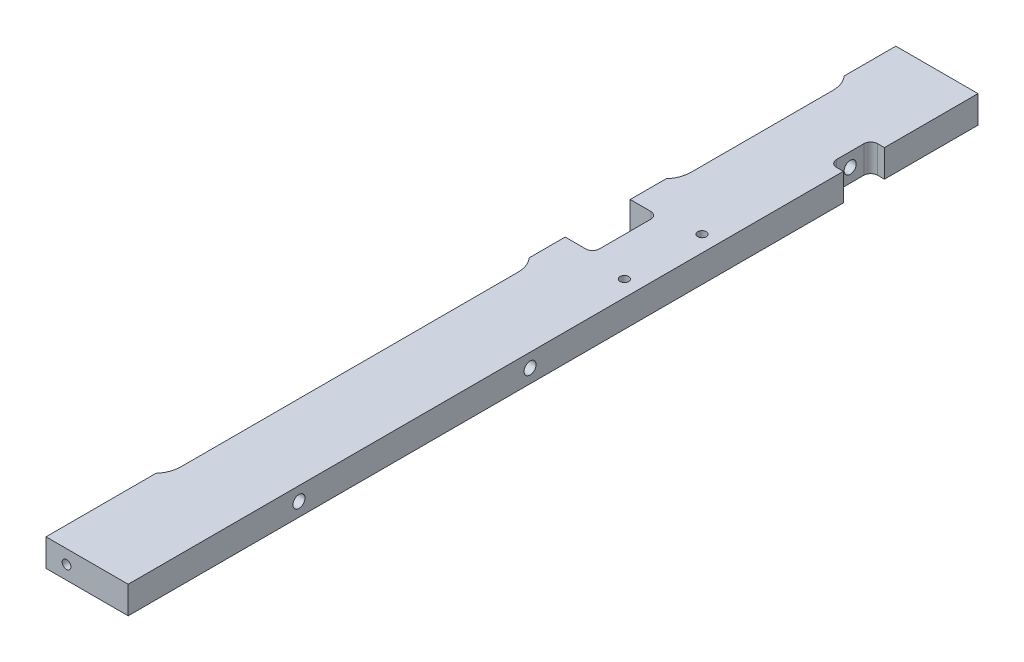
ISO-10303-21;
HEADER;
FILE_DESCRIPTION(('STEP AP214'),'2;1');
FILE_NAME('part.step','',(''),(''),'','','');
FILE_SCHEMA(('AUTOMOTIVE_DESIGN { 1 0 10303 214 1 1 1 1 }'));
ENDSEC;
DATA;
#1=APPLICATION_CONTEXT('core data for automotive mechanical design processes');
#2=APPLICATION_PROTOCOL_DEFINITION('international standard','automotive_design',2000,#1);
#3=PRODUCT_CONTEXT('',#1,'mechanical');
#4=PRODUCT('Part','Part','',(#3));
#5=PRODUCT_RELATED_PRODUCT_CATEGORY('part','',(#4));
#6=PRODUCT_DEFINITION_FORMATION('','',#4);
#7=PRODUCT_DEFINITION_CONTEXT('part definition',#1,'design');
#8=PRODUCT_DEFINITION('design','',#6,#7);
#9=PRODUCT_DEFINITION_SHAPE('','',#8);
#10=(LENGTH_UNIT() NAMED_UNIT(*) SI_UNIT(.MILLI.,.METRE.));
#11=(NAMED_UNIT(*) PLANE_ANGLE_UNIT() SI_UNIT($,.RADIAN.));
#12=(NAMED_UNIT(*) SI_UNIT($,.STERADIAN.) SOLID_ANGLE_UNIT());
#13=UNCERTAINTY_MEASURE_WITH_UNIT(LENGTH_MEASURE(1.E-05),#10,'distance_accuracy_value','');
#14=(GEOMETRIC_REPRESENTATION_CONTEXT(3) GLOBAL_UNCERTAINTY_ASSIGNED_CONTEXT((#13)) GLOBAL_UNIT_ASSIGNED_CONTEXT((#10,
#11,#12)) REPRESENTATION_CONTEXT('',''));
#15=CARTESIAN_POINT('',(0.,0.,0.));
#16=DIRECTION('',(0.,0.,1.));
#17=DIRECTION('',(1.,0.,0.));
#18=AXIS2_PLACEMENT_3D('',#15,#16,#17);
#19=CARTESIAN_POINT('',(0.,6.35,-197.74535));
#20=DIRECTION('',(-1.,0.,0.));
#21=DIRECTION('',(0.,0.,1.));
#22=AXIS2_PLACEMENT_3D('',#19,#20,#21);
#23=PLANE('',#22);
#24=CARTESIAN_POINT('',(0.,0.,11.4013721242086));
#25=DIRECTION('',(-1.,0.,0.));
#26=DIRECTION('',(0.,0.,1.));
#27=AXIS2_PLACEMENT_3D('',#24,#25,#26);
#28=CIRCLE('',#27,2.80669999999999);
#29=CARTESIAN_POINT('',(0.,0.,14.2080721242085));
#30=VERTEX_POINT('',#29);
#31=EDGE_CURVE('E285',#30,#30,#28,.T.);
#32=ORIENTED_EDGE('',*,*,#31,.T.);
#33=EDGE_LOOP('',(#32));
#34=FACE_BOUND('',#33,.T.);
#35=CARTESIAN_POINT('',(0.,0.,118.570427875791));
#36=DIRECTION('',(-1.,0.,0.));
#37=DIRECTION('',(0.,0.,1.));
#38=AXIS2_PLACEMENT_3D('',#35,#36,#37);
#39=CIRCLE('',#38,2.80669999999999);
#40=CARTESIAN_POINT('',(0.,0.,121.377127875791));
#41=VERTEX_POINT('',#40);
#42=EDGE_CURVE('E273',#41,#41,#39,.T.);
#43=ORIENTED_EDGE('',*,*,#42,.T.);
#44=EDGE_LOOP('',(#43));
#45=FACE_BOUND('',#44,.T.);
#46=DIRECTION('',(0.,0.,-1.));
#47=VECTOR('',#46,1.);
#48=CARTESIAN_POINT('',(0.,-6.35,-197.74535));
#49=LINE('',#48,#47);
#50=CARTESIAN_POINT('',(0.,-6.35,197.74535));
#51=VERTEX_POINT('',#50);
#52=CARTESIAN_POINT('',(0.,-6.35,-133.842072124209));
#53=VERTEX_POINT('',#52);
#54=EDGE_CURVE('E382',#51,#53,#49,.T.);
#55=ORIENTED_EDGE('',*,*,#54,.T.);
#56=DIRECTION('',(0.,-1.,0.));
#57=VECTOR('',#56,1.);
#58=CARTESIAN_POINT('',(0.,-6.35,-133.842072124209));
#59=LINE('',#58,#57);
#60=CARTESIAN_POINT('',(0.,6.35,-133.842072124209));
#61=VERTEX_POINT('',#60);
#62=EDGE_CURVE('E212',#61,#53,#59,.T.);
#63=ORIENTED_EDGE('',*,*,#62,.F.);
#64=DIRECTION('',(0.,0.,-1.));
#65=VECTOR('',#64,1.);
#66=CARTESIAN_POINT('',(0.,6.35,-197.74535));
#67=LINE('',#66,#65);
#68=CARTESIAN_POINT('',(0.,6.35,197.74535));
#69=VERTEX_POINT('',#68);
#70=EDGE_CURVE('E371',#69,#61,#67,.T.);
#71=ORIENTED_EDGE('',*,*,#70,.F.);
#72=DIRECTION('',(0.,-1.,0.));
#73=VECTOR('',#72,1.);
#74=CARTESIAN_POINT('',(0.,6.35,197.74535));
#75=LINE('',#74,#73);
#76=EDGE_CURVE('E374',#69,#51,#75,.T.);
#77=ORIENTED_EDGE('',*,*,#76,.T.);
#78=EDGE_LOOP('',(#55,#63,#71,#77));
#79=FACE_BOUND('',#78,.T.);
#80=ADVANCED_FACE('F37',(#34,#45,#79),#23,.F.);
#81=CARTESIAN_POINT('',(-38.1,6.35,197.74535));
#82=DIRECTION('',(1.,0.,0.));
#83=DIRECTION('',(0.,0.,-1.));
#84=AXIS2_PLACEMENT_3D('',#81,#82,#83);
#85=PLANE('',#84);
#86=DIRECTION('',(0.,0.,1.));
#87=VECTOR('',#86,1.);
#88=CARTESIAN_POINT('',(-38.1,-6.35,197.74535));
#89=LINE('',#88,#87);
#90=CARTESIAN_POINT('',(-38.0999999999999,-6.35,-89.79535));
#91=VERTEX_POINT('',#90);
#92=CARTESIAN_POINT('',(-38.1,-6.35,-73.1266));
#93=VERTEX_POINT('',#92);
#94=EDGE_CURVE('E378',#91,#93,#89,.T.);
#95=ORIENTED_EDGE('',*,*,#94,.T.);
#96=DIRECTION('',(0.,1.,0.));
#97=VECTOR('',#96,1.);
#98=CARTESIAN_POINT('',(-38.1,-6.35,-73.1266));
#99=LINE('',#98,#97);
#100=CARTESIAN_POINT('',(-38.1,6.35,-73.1266));
#101=VERTEX_POINT('',#100);
#102=EDGE_CURVE('E249',#93,#101,#99,.T.);
#103=ORIENTED_EDGE('',*,*,#102,.T.);
#104=DIRECTION('',(0.,0.,1.));
#105=VECTOR('',#104,1.);
#106=CARTESIAN_POINT('',(-38.1,6.35,197.74535));
#107=LINE('',#106,#105);
#108=CARTESIAN_POINT('',(-38.0999999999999,6.35,-89.79535));
#109=VERTEX_POINT('',#108);
#110=EDGE_CURVE('E367',#109,#101,#107,.T.);
#111=ORIENTED_EDGE('',*,*,#110,.F.);
#112=DIRECTION('',(0.,1.,0.));
#113=VECTOR('',#112,1.);
#114=CARTESIAN_POINT('',(-38.0999999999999,-6.35,-89.79535));
#115=LINE('',#114,#113);
#116=EDGE_CURVE('E343',#91,#109,#115,.T.);
#117=ORIENTED_EDGE('',*,*,#116,.F.);
#118=EDGE_LOOP('',(#95,#103,#111,#117));
#119=FACE_BOUND('',#118,.T.);
#120=ADVANCED_FACE('F521',(#119),#85,.F.);
#121=CARTESIAN_POINT('',(-38.1,6.35,-42.9641));
#122=VERTEX_POINT('',#121);
#123=CARTESIAN_POINT('',(-38.1,6.35,-26.29535));
#124=VERTEX_POINT('',#123);
#125=EDGE_CURVE('E368',#122,#124,#107,.T.);
#126=ORIENTED_EDGE('',*,*,#125,.F.);
#127=DIRECTION('',(0.,1.,0.));
#128=VECTOR('',#127,1.);
#129=CARTESIAN_POINT('',(-38.1,-6.35,-42.9641));
#130=LINE('',#129,#128);
#131=CARTESIAN_POINT('',(-38.1,-6.35,-42.9641));
#132=VERTEX_POINT('',#131);
#133=EDGE_CURVE('E242',#132,#122,#130,.T.);
#134=ORIENTED_EDGE('',*,*,#133,.F.);
#135=CARTESIAN_POINT('',(-38.1,-6.35,-26.29535));
#136=VERTEX_POINT('',#135);
#137=EDGE_CURVE('E379',#132,#136,#89,.T.);
#138=ORIENTED_EDGE('',*,*,#137,.T.);
#139=DIRECTION('',(0.,1.,0.));
#140=VECTOR('',#139,1.);
#141=CARTESIAN_POINT('',(-38.1,-6.35,-26.29535));
#142=LINE('',#141,#140);
#143=EDGE_CURVE('E308',#136,#124,#142,.T.);
#144=ORIENTED_EDGE('',*,*,#143,.T.);
#145=EDGE_LOOP('',(#126,#134,#138,#144));
#146=FACE_BOUND('',#145,.T.);
#147=ADVANCED_FACE('F453',(#146),#85,.F.);
#148=CARTESIAN_POINT('',(-38.0999999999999,6.35,146.74215));
#149=VERTEX_POINT('',#148);
#150=CARTESIAN_POINT('',(-38.1,6.35,197.74535));
#151=VERTEX_POINT('',#150);
#152=EDGE_CURVE('E385',#149,#151,#107,.T.);
#153=ORIENTED_EDGE('',*,*,#152,.F.);
#154=DIRECTION('',(0.,1.,0.));
#155=VECTOR('',#154,1.);
#156=CARTESIAN_POINT('',(-38.0999999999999,-6.35,146.74215));
#157=LINE('',#156,#155);
#158=CARTESIAN_POINT('',(-38.0999999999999,-6.35,146.74215));
#159=VERTEX_POINT('',#158);
#160=EDGE_CURVE('E321',#159,#149,#157,.T.);
#161=ORIENTED_EDGE('',*,*,#160,.F.);
#162=CARTESIAN_POINT('',(-38.1,-6.35,197.74535));
#163=VERTEX_POINT('',#162);
#164=EDGE_CURVE('E363',#159,#163,#89,.T.);
#165=ORIENTED_EDGE('',*,*,#164,.T.);
#166=DIRECTION('',(0.,-1.,0.));
#167=VECTOR('',#166,1.);
#168=CARTESIAN_POINT('',(-38.1,6.35,197.74535));
#169=LINE('',#168,#167);
#170=EDGE_CURVE('E388',#151,#163,#169,.T.);
#171=ORIENTED_EDGE('',*,*,#170,.F.);
#172=EDGE_LOOP('',(#153,#161,#165,#171));
#173=FACE_BOUND('',#172,.T.);
#174=ADVANCED_FACE('F464',(#173),#85,.F.);
#175=CARTESIAN_POINT('',(-38.1,6.35,-196.27215));
#176=VERTEX_POINT('',#175);
#177=CARTESIAN_POINT('',(-38.1,6.35,-172.34535));
#178=VERTEX_POINT('',#177);
#179=EDGE_CURVE('E364',#176,#178,#107,.T.);
#180=ORIENTED_EDGE('',*,*,#179,.F.);
#181=DIRECTION('',(0.,1.,0.));
#182=VECTOR('',#181,1.);
#183=CARTESIAN_POINT('',(-38.1,-6.35,-196.27215));
#184=LINE('',#183,#182);
#185=CARTESIAN_POINT('',(-38.1,-6.35,-196.27215));
#186=VERTEX_POINT('',#185);
#187=EDGE_CURVE('E257',#186,#176,#184,.T.);
#188=ORIENTED_EDGE('',*,*,#187,.F.);
#189=CARTESIAN_POINT('',(-38.1,-6.35,-172.34535));
#190=VERTEX_POINT('',#189);
#191=EDGE_CURVE('E375',#186,#190,#89,.T.);
#192=ORIENTED_EDGE('',*,*,#191,.T.);
#193=DIRECTION('',(0.,1.,0.));
#194=VECTOR('',#193,1.);
#195=CARTESIAN_POINT('',(-38.1,-6.35,-172.34535));
#196=LINE('',#195,#194);
#197=EDGE_CURVE('E346',#190,#178,#196,.T.);
#198=ORIENTED_EDGE('',*,*,#197,.T.);
#199=EDGE_LOOP('',(#180,#188,#192,#198));
#200=FACE_BOUND('',#199,.T.);
#201=ADVANCED_FACE('F506',(#200),#85,.F.);
#202=CARTESIAN_POINT('',(0.,6.35,197.74535));
#203=DIRECTION('',(0.,0.,-1.));
#204=DIRECTION('',(-1.,0.,0.));
#205=AXIS2_PLACEMENT_3D('',#202,#203,#204);
#206=PLANE('',#205);
#207=CARTESIAN_POINT('',(-28.575,0.,197.74535));
#208=DIRECTION('',(0.,0.,1.));
#209=DIRECTION('',(1.,0.,0.));
#210=AXIS2_PLACEMENT_3D('',#207,#208,#209);
#211=CIRCLE('',#210,2.01929999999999);
#212=CARTESIAN_POINT('',(-26.5557,0.,197.74535));
#213=VERTEX_POINT('',#212);
#214=EDGE_CURVE('E209',#213,#213,#211,.T.);
#215=ORIENTED_EDGE('',*,*,#214,.F.);
#216=EDGE_LOOP('',(#215));
#217=FACE_BOUND('',#216,.T.);
#218=DIRECTION('',(1.,0.,0.));
#219=VECTOR('',#218,1.);
#220=CARTESIAN_POINT('',(0.,-6.35,197.74535));
#221=LINE('',#220,#219);
#222=EDGE_CURVE('E377',#163,#51,#221,.T.);
#223=ORIENTED_EDGE('',*,*,#222,.T.);
#224=ORIENTED_EDGE('',*,*,#76,.F.);
#225=DIRECTION('',(1.,0.,0.));
#226=VECTOR('',#225,1.);
#227=CARTESIAN_POINT('',(0.,6.35,197.74535));
#228=LINE('',#227,#226);
#229=EDGE_CURVE('E366',#151,#69,#228,.T.);
#230=ORIENTED_EDGE('',*,*,#229,.F.);
#231=ORIENTED_EDGE('',*,*,#170,.T.);
#232=EDGE_LOOP('',(#223,#224,#230,#231));
#233=FACE_BOUND('',#232,.T.);
#234=ADVANCED_FACE('F468',(#217,#233),#206,.F.);
#235=CARTESIAN_POINT('',(0.,6.35,-152.892072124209));
#236=VERTEX_POINT('',#235);
#237=CARTESIAN_POINT('',(0.,6.35,-196.27215));
#238=VERTEX_POINT('',#237);
#239=EDGE_CURVE('E370',#236,#238,#67,.T.);
#240=ORIENTED_EDGE('',*,*,#239,.F.);
#241=DIRECTION('',(0.,1.,0.));
#242=VECTOR('',#241,1.);
#243=CARTESIAN_POINT('',(0.,-6.35,-152.892072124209));
#244=LINE('',#243,#242);
#245=CARTESIAN_POINT('',(0.,-6.35,-152.892072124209));
#246=VERTEX_POINT('',#245);
#247=EDGE_CURVE('E208',#246,#236,#244,.T.);
#248=ORIENTED_EDGE('',*,*,#247,.F.);
#249=CARTESIAN_POINT('',(0.,-6.35,-196.27215));
#250=VERTEX_POINT('',#249);
#251=EDGE_CURVE('E381',#246,#250,#49,.T.);
#252=ORIENTED_EDGE('',*,*,#251,.T.);
#253=DIRECTION('',(0.,1.,0.));
#254=VECTOR('',#253,1.);
#255=CARTESIAN_POINT('',(0.,-6.35,-196.27215));
#256=LINE('',#255,#254);
#257=EDGE_CURVE('E260',#250,#238,#256,.T.);
#258=ORIENTED_EDGE('',*,*,#257,.T.);
#259=EDGE_LOOP('',(#240,#248,#252,#258));
#260=FACE_BOUND('',#259,.T.);
#261=ADVANCED_FACE('F497',(#260),#23,.F.);
#262=CARTESIAN_POINT('',(0.,6.35,0.));
#263=DIRECTION('',(0.,-1.,0.));
#264=DIRECTION('',(0.,0.,-1.));
#265=AXIS2_PLACEMENT_3D('',#262,#263,#264);
#266=PLANE('',#265);
#267=ORIENTED_EDGE('',*,*,#70,.T.);
#268=DIRECTION('',(1.,0.,0.));
#269=VECTOR('',#268,1.);
#270=CARTESIAN_POINT('',(-6.35,6.35,-133.842072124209));
#271=LINE('',#270,#269);
#272=CARTESIAN_POINT('',(-3.175,6.35,-133.842072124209));
#273=VERTEX_POINT('',#272);
#274=EDGE_CURVE('E229',#273,#61,#271,.T.);
#275=ORIENTED_EDGE('',*,*,#274,.F.);
#276=CARTESIAN_POINT('',(-3.175,6.35,-137.017072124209));
#277=DIRECTION('',(0.,-1.,0.));
#278=DIRECTION('',(0.,0.,-1.));
#279=AXIS2_PLACEMENT_3D('',#276,#277,#278);
#280=CIRCLE('',#279,3.175);
#281=CARTESIAN_POINT('',(-6.35,6.35,-137.017072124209));
#282=VERTEX_POINT('',#281);
#283=EDGE_CURVE('E418',#273,#282,#280,.T.);
#284=ORIENTED_EDGE('',*,*,#283,.T.);
#285=DIRECTION('',(0.,0.,1.));
#286=VECTOR('',#285,1.);
#287=CARTESIAN_POINT('',(-6.35,6.35,-152.892072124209));
#288=LINE('',#287,#286);
#289=CARTESIAN_POINT('',(-6.35,6.35,-149.717072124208));
#290=VERTEX_POINT('',#289);
#291=EDGE_CURVE('E220',#290,#282,#288,.T.);
#292=ORIENTED_EDGE('',*,*,#291,.F.);
#293=CARTESIAN_POINT('',(-3.175,6.35,-149.717072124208));
#294=DIRECTION('',(0.,-1.,0.));
#295=DIRECTION('',(0.,0.,-1.));
#296=AXIS2_PLACEMENT_3D('',#293,#294,#295);
#297=CIRCLE('',#296,3.175);
#298=CARTESIAN_POINT('',(-3.175,6.35,-152.892072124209));
#299=VERTEX_POINT('',#298);
#300=EDGE_CURVE('E412',#290,#299,#297,.T.);
#301=ORIENTED_EDGE('',*,*,#300,.T.);
#302=DIRECTION('',(1.,0.,0.));
#303=VECTOR('',#302,1.);
#304=CARTESIAN_POINT('',(-6.35,6.35,-152.892072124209));
#305=LINE('',#304,#303);
#306=EDGE_CURVE('E231',#299,#236,#305,.T.);
#307=ORIENTED_EDGE('',*,*,#306,.T.);
#308=ORIENTED_EDGE('',*,*,#239,.T.);
#309=DIRECTION('',(1.,0.,0.));
#310=VECTOR('',#309,1.);
#311=CARTESIAN_POINT('',(-38.1,6.35,-196.27215));
#312=LINE('',#311,#310);
#313=EDGE_CURVE('E252',#176,#238,#312,.T.);
#314=ORIENTED_EDGE('',*,*,#313,.F.);
#315=ORIENTED_EDGE('',*,*,#179,.T.);
#316=CARTESIAN_POINT('',(-47.625,6.35,-163.94508958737));
#317=DIRECTION('',(0.,1.,0.));
#318=DIRECTION('',(0.,0.,1.));
#319=AXIS2_PLACEMENT_3D('',#316,#317,#318);
#320=CIRCLE('',#319,12.7);
#321=CARTESIAN_POINT('',(-34.925,6.35,-163.94508958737));
#322=VERTEX_POINT('',#321);
#323=EDGE_CURVE('E329',#322,#178,#320,.T.);
#324=ORIENTED_EDGE('',*,*,#323,.F.);
#325=DIRECTION('',(0.,0.,-1.));
#326=VECTOR('',#325,1.);
#327=CARTESIAN_POINT('',(-34.925,6.35,-163.94508958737));
#328=LINE('',#327,#326);
#329=CARTESIAN_POINT('',(-34.9249999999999,6.35,-98.1956104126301));
#330=VERTEX_POINT('',#329);
#331=EDGE_CURVE('E338',#330,#322,#328,.T.);
#332=ORIENTED_EDGE('',*,*,#331,.F.);
#333=CARTESIAN_POINT('',(-47.625,6.35,-98.1956104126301));
#334=DIRECTION('',(0.,1.,0.));
#335=DIRECTION('',(0.,0.,-1.));
#336=AXIS2_PLACEMENT_3D('',#333,#334,#335);
#337=CIRCLE('',#336,12.7);
#338=EDGE_CURVE('E318',#109,#330,#337,.T.);
#339=ORIENTED_EDGE('',*,*,#338,.F.);
#340=ORIENTED_EDGE('',*,*,#110,.T.);
#341=DIRECTION('',(-1.,0.,0.));
#342=VECTOR('',#341,1.);
#343=CARTESIAN_POINT('',(-38.1,6.35,-73.1266));
#344=LINE('',#343,#342);
#345=CARTESIAN_POINT('',(-28.575,6.35,-73.1266));
#346=VERTEX_POINT('',#345);
#347=EDGE_CURVE('E237',#346,#101,#344,.T.);
#348=ORIENTED_EDGE('',*,*,#347,.F.);
#349=CARTESIAN_POINT('',(-28.575,6.35,-69.9516));
#350=DIRECTION('',(0.,-1.,0.));
#351=DIRECTION('',(0.,0.,-1.));
#352=AXIS2_PLACEMENT_3D('',#349,#350,#351);
#353=CIRCLE('',#352,3.175);
#354=CARTESIAN_POINT('',(-25.4,6.35,-69.9516));
#355=VERTEX_POINT('',#354);
#356=EDGE_CURVE('E420',#346,#355,#353,.T.);
#357=ORIENTED_EDGE('',*,*,#356,.T.);
#358=DIRECTION('',(0.,0.,-1.));
#359=VECTOR('',#358,1.);
#360=CARTESIAN_POINT('',(-25.4,6.35,-42.9641));
#361=LINE('',#360,#359);
#362=CARTESIAN_POINT('',(-25.4,6.35,-46.1391));
#363=VERTEX_POINT('',#362);
#364=EDGE_CURVE('E245',#363,#355,#361,.T.);
#365=ORIENTED_EDGE('',*,*,#364,.F.);
#366=CARTESIAN_POINT('',(-28.575,6.35,-46.1391));
#367=DIRECTION('',(0.,-1.,0.));
#368=DIRECTION('',(0.,0.,-1.));
#369=AXIS2_PLACEMENT_3D('',#366,#367,#368);
#370=CIRCLE('',#369,3.175);
#371=CARTESIAN_POINT('',(-28.575,6.35,-42.9641));
#372=VERTEX_POINT('',#371);
#373=EDGE_CURVE('E45',#363,#372,#370,.T.);
#374=ORIENTED_EDGE('',*,*,#373,.T.);
#375=DIRECTION('',(1.,0.,0.));
#376=VECTOR('',#375,1.);
#377=CARTESIAN_POINT('',(-38.1,6.35,-42.9641));
#378=LINE('',#377,#376);
#379=EDGE_CURVE('E243',#122,#372,#378,.T.);
#380=ORIENTED_EDGE('',*,*,#379,.F.);
#381=ORIENTED_EDGE('',*,*,#125,.T.);
#382=CARTESIAN_POINT('',(-47.6249999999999,6.35,-17.8950895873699));
#383=DIRECTION('',(0.,1.,0.));
#384=DIRECTION('',(0.,0.,1.));
#385=AXIS2_PLACEMENT_3D('',#382,#383,#384);
#386=CIRCLE('',#385,12.7);
#387=CARTESIAN_POINT('',(-34.9249999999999,6.35,-17.8950895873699));
#388=VERTEX_POINT('',#387);
#389=EDGE_CURVE('E297',#388,#124,#386,.T.);
#390=ORIENTED_EDGE('',*,*,#389,.F.);
#391=DIRECTION('',(0.,0.,-1.));
#392=VECTOR('',#391,1.);
#393=CARTESIAN_POINT('',(-34.9249999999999,6.35,-17.8950895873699));
#394=LINE('',#393,#392);
#395=CARTESIAN_POINT('',(-34.9249999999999,6.35,138.34188958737));
#396=VERTEX_POINT('',#395);
#397=EDGE_CURVE('E302',#396,#388,#394,.T.);
#398=ORIENTED_EDGE('',*,*,#397,.F.);
#399=CARTESIAN_POINT('',(-47.6249999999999,6.35,138.34188958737));
#400=DIRECTION('',(0.,1.,0.));
#401=DIRECTION('',(0.,0.,-1.));
#402=AXIS2_PLACEMENT_3D('',#399,#400,#401);
#403=CIRCLE('',#402,12.7);
#404=EDGE_CURVE('E311',#149,#396,#403,.T.);
#405=ORIENTED_EDGE('',*,*,#404,.F.);
#406=ORIENTED_EDGE('',*,*,#152,.T.);
#407=ORIENTED_EDGE('',*,*,#229,.T.);
#408=EDGE_LOOP('',(#267,#275,#284,#292,#301,#307,#308,#314,#315,#324,#332,#339,#340,#348,#357,
#365,#374,#380,#381,#390,#398,#405,#406,#407));
#409=FACE_BOUND('',#408,.T.);
#410=CARTESIAN_POINT('',(-7.5,6.35,-75.84215));
#411=DIRECTION('',(0.,1.,0.));
#412=DIRECTION('',(0.,0.,1.));
#413=AXIS2_PLACEMENT_3D('',#410,#411,#412);
#414=CIRCLE('',#413,2.01929999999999);
#415=CARTESIAN_POINT('',(-7.5,6.35,-73.82285));
#416=VERTEX_POINT('',#415);
#417=EDGE_CURVE('E345',#416,#416,#414,.T.);
#418=ORIENTED_EDGE('',*,*,#417,.F.);
#419=EDGE_LOOP('',(#418));
#420=FACE_BOUND('',#419,.T.);
#421=CARTESIAN_POINT('',(-7.5,6.35,-39.84215));
#422=DIRECTION('',(0.,1.,0.));
#423=DIRECTION('',(0.,0.,1.));
#424=AXIS2_PLACEMENT_3D('',#421,#422,#423);
#425=CIRCLE('',#424,2.01929999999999);
#426=CARTESIAN_POINT('',(-7.5,6.35,-37.82285));
#427=VERTEX_POINT('',#426);
#428=EDGE_CURVE('E357',#427,#427,#425,.T.);
#429=ORIENTED_EDGE('',*,*,#428,.F.);
#430=EDGE_LOOP('',(#429));
#431=FACE_BOUND('',#430,.T.);
#432=ADVANCED_FACE('F440',(#409,#420,#431),#266,.F.);
#433=CARTESIAN_POINT('',(0.,-6.35,0.));
#434=DIRECTION('',(0.,-1.,0.));
#435=DIRECTION('',(0.,0.,-1.));
#436=AXIS2_PLACEMENT_3D('',#433,#434,#435);
#437=PLANE('',#436);
#438=DIRECTION('',(0.,0.,-1.));
#439=VECTOR('',#438,1.);
#440=CARTESIAN_POINT('',(-6.35,-6.35,-152.892072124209));
#441=LINE('',#440,#439);
#442=CARTESIAN_POINT('',(-6.35,-6.35,-137.017072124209));
#443=VERTEX_POINT('',#442);
#444=CARTESIAN_POINT('',(-6.35,-6.35,-149.717072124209));
#445=VERTEX_POINT('',#444);
#446=EDGE_CURVE('E217',#443,#445,#441,.T.);
#447=ORIENTED_EDGE('',*,*,#446,.F.);
#448=CARTESIAN_POINT('',(-3.175,-6.35,-137.017072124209));
#449=DIRECTION('',(0.,-1.,0.));
#450=DIRECTION('',(0.,0.,-1.));
#451=AXIS2_PLACEMENT_3D('',#448,#449,#450);
#452=CIRCLE('',#451,3.175);
#453=CARTESIAN_POINT('',(-3.175,-6.35,-133.842072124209));
#454=VERTEX_POINT('',#453);
#455=EDGE_CURVE('E416',#443,#454,#452,.F.);
#456=ORIENTED_EDGE('',*,*,#455,.T.);
#457=DIRECTION('',(1.,0.,0.));
#458=VECTOR('',#457,1.);
#459=CARTESIAN_POINT('',(-6.35,-6.35,-133.842072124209));
#460=LINE('',#459,#458);
#461=EDGE_CURVE('E226',#454,#53,#460,.T.);
#462=ORIENTED_EDGE('',*,*,#461,.T.);
#463=ORIENTED_EDGE('',*,*,#54,.F.);
#464=ORIENTED_EDGE('',*,*,#222,.F.);
#465=ORIENTED_EDGE('',*,*,#164,.F.);
#466=CARTESIAN_POINT('',(-47.6249999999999,-6.35,138.34188958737));
#467=DIRECTION('',(0.,1.,0.));
#468=DIRECTION('',(0.,0.,-1.));
#469=AXIS2_PLACEMENT_3D('',#466,#467,#468);
#470=CIRCLE('',#469,12.7);
#471=CARTESIAN_POINT('',(-34.9249999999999,-6.35,138.34188958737));
#472=VERTEX_POINT('',#471);
#473=EDGE_CURVE('E301',#159,#472,#470,.T.);
#474=ORIENTED_EDGE('',*,*,#473,.T.);
#475=DIRECTION('',(0.,0.,-1.));
#476=VECTOR('',#475,1.);
#477=CARTESIAN_POINT('',(-34.9249999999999,-6.35,-17.8950895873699));
#478=LINE('',#477,#476);
#479=CARTESIAN_POINT('',(-34.9249999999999,-6.35,-17.8950895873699));
#480=VERTEX_POINT('',#479);
#481=EDGE_CURVE('E305',#472,#480,#478,.T.);
#482=ORIENTED_EDGE('',*,*,#481,.T.);
#483=CARTESIAN_POINT('',(-47.6249999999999,-6.35,-17.8950895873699));
#484=DIRECTION('',(0.,1.,0.));
#485=DIRECTION('',(0.,0.,1.));
#486=AXIS2_PLACEMENT_3D('',#483,#484,#485);
#487=CIRCLE('',#486,12.7);
#488=EDGE_CURVE('E298',#480,#136,#487,.T.);
#489=ORIENTED_EDGE('',*,*,#488,.T.);
#490=ORIENTED_EDGE('',*,*,#137,.F.);
#491=DIRECTION('',(1.,0.,0.));
#492=VECTOR('',#491,1.);
#493=CARTESIAN_POINT('',(-38.1,-6.35,-42.9641));
#494=LINE('',#493,#492);
#495=CARTESIAN_POINT('',(-28.575,-6.35,-42.9641));
#496=VERTEX_POINT('',#495);
#497=EDGE_CURVE('E234',#132,#496,#494,.T.);
#498=ORIENTED_EDGE('',*,*,#497,.T.);
#499=CARTESIAN_POINT('',(-28.575,-6.35,-46.1391));
#500=DIRECTION('',(0.,-1.,0.));
#501=DIRECTION('',(0.,0.,-1.));
#502=AXIS2_PLACEMENT_3D('',#499,#500,#501);
#503=CIRCLE('',#502,3.175);
#504=CARTESIAN_POINT('',(-25.4,-6.35,-46.1391));
#505=VERTEX_POINT('',#504);
#506=EDGE_CURVE('E11',#496,#505,#503,.F.);
#507=ORIENTED_EDGE('',*,*,#506,.T.);
#508=DIRECTION('',(0.,0.,-1.));
#509=VECTOR('',#508,1.);
#510=CARTESIAN_POINT('',(-25.4,-6.35,-42.9641));
#511=LINE('',#510,#509);
#512=CARTESIAN_POINT('',(-25.4,-6.35,-69.9516));
#513=VERTEX_POINT('',#512);
#514=EDGE_CURVE('E236',#505,#513,#511,.T.);
#515=ORIENTED_EDGE('',*,*,#514,.T.);
#516=CARTESIAN_POINT('',(-28.575,-6.35,-69.9516));
#517=DIRECTION('',(0.,-1.,0.));
#518=DIRECTION('',(0.,0.,-1.));
#519=AXIS2_PLACEMENT_3D('',#516,#517,#518);
#520=CIRCLE('',#519,3.175);
#521=CARTESIAN_POINT('',(-28.575,-6.35,-73.1266));
#522=VERTEX_POINT('',#521);
#523=EDGE_CURVE('E422',#513,#522,#520,.F.);
#524=ORIENTED_EDGE('',*,*,#523,.T.);
#525=DIRECTION('',(-1.,0.,0.));
#526=VECTOR('',#525,1.);
#527=CARTESIAN_POINT('',(-38.1,-6.35,-73.1266));
#528=LINE('',#527,#526);
#529=EDGE_CURVE('E240',#522,#93,#528,.T.);
#530=ORIENTED_EDGE('',*,*,#529,.T.);
#531=ORIENTED_EDGE('',*,*,#94,.F.);
#532=CARTESIAN_POINT('',(-47.625,-6.35,-98.1956104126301));
#533=DIRECTION('',(0.,1.,0.));
#534=DIRECTION('',(0.,0.,-1.));
#535=AXIS2_PLACEMENT_3D('',#532,#533,#534);
#536=CIRCLE('',#535,12.7);
#537=CARTESIAN_POINT('',(-34.9249999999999,-6.35,-98.1956104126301));
#538=VERTEX_POINT('',#537);
#539=EDGE_CURVE('E325',#91,#538,#536,.T.);
#540=ORIENTED_EDGE('',*,*,#539,.T.);
#541=DIRECTION('',(0.,0.,-1.));
#542=VECTOR('',#541,1.);
#543=CARTESIAN_POINT('',(-34.925,-6.35,-163.94508958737));
#544=LINE('',#543,#542);
#545=CARTESIAN_POINT('',(-34.925,-6.35,-163.94508958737));
#546=VERTEX_POINT('',#545);
#547=EDGE_CURVE('E328',#538,#546,#544,.T.);
#548=ORIENTED_EDGE('',*,*,#547,.T.);
#549=CARTESIAN_POINT('',(-47.625,-6.35,-163.94508958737));
#550=DIRECTION('',(0.,1.,0.));
#551=DIRECTION('',(0.,0.,1.));
#552=AXIS2_PLACEMENT_3D('',#549,#550,#551);
#553=CIRCLE('',#552,12.7);
#554=EDGE_CURVE('E332',#546,#190,#553,.T.);
#555=ORIENTED_EDGE('',*,*,#554,.T.);
#556=ORIENTED_EDGE('',*,*,#191,.F.);
#557=DIRECTION('',(1.,0.,0.));
#558=VECTOR('',#557,1.);
#559=CARTESIAN_POINT('',(-38.1,-6.35,-196.27215));
#560=LINE('',#559,#558);
#561=EDGE_CURVE('E254',#186,#250,#560,.T.);
#562=ORIENTED_EDGE('',*,*,#561,.T.);
#563=ORIENTED_EDGE('',*,*,#251,.F.);
#564=DIRECTION('',(1.,0.,0.));
#565=VECTOR('',#564,1.);
#566=CARTESIAN_POINT('',(-6.35,-6.35,-152.892072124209));
#567=LINE('',#566,#565);
#568=CARTESIAN_POINT('',(-3.175,-6.35,-152.892072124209));
#569=VERTEX_POINT('',#568);
#570=EDGE_CURVE('E222',#569,#246,#567,.T.);
#571=ORIENTED_EDGE('',*,*,#570,.F.);
#572=CARTESIAN_POINT('',(-3.175,-6.35,-149.717072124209));
#573=DIRECTION('',(0.,-1.,0.));
#574=DIRECTION('',(0.,0.,-1.));
#575=AXIS2_PLACEMENT_3D('',#572,#573,#574);
#576=CIRCLE('',#575,3.175);
#577=EDGE_CURVE('E414',#569,#445,#576,.F.);
#578=ORIENTED_EDGE('',*,*,#577,.T.);
#579=EDGE_LOOP('',(#447,#456,#462,#463,#464,#465,#474,#482,#489,#490,#498,#507,#515,#524,#530,
#531,#540,#548,#555,#556,#562,#563,#571,#578));
#580=FACE_BOUND('',#579,.T.);
#581=CARTESIAN_POINT('',(-7.5,-6.35,-75.84215));
#582=DIRECTION('',(0.,1.,0.));
#583=DIRECTION('',(0.,0.,1.));
#584=AXIS2_PLACEMENT_3D('',#581,#582,#583);
#585=CIRCLE('',#584,2.0193);
#586=CARTESIAN_POINT('',(-7.5,-6.35,-73.82285));
#587=VERTEX_POINT('',#586);
#588=EDGE_CURVE('E354',#587,#587,#585,.T.);
#589=ORIENTED_EDGE('',*,*,#588,.T.);
#590=EDGE_LOOP('',(#589));
#591=FACE_BOUND('',#590,.T.);
#592=CARTESIAN_POINT('',(-7.5,-6.35,-39.84215));
#593=DIRECTION('',(0.,1.,0.));
#594=DIRECTION('',(0.,0.,1.));
#595=AXIS2_PLACEMENT_3D('',#592,#593,#594);
#596=CIRCLE('',#595,2.0193);
#597=CARTESIAN_POINT('',(-7.5,-6.35,-37.82285));
#598=VERTEX_POINT('',#597);
#599=EDGE_CURVE('E360',#598,#598,#596,.T.);
#600=ORIENTED_EDGE('',*,*,#599,.T.);
#601=EDGE_LOOP('',(#600));
#602=FACE_BOUND('',#601,.T.);
#603=ADVANCED_FACE('F427',(#580,#591,#602),#437,.T.);
#604=CARTESIAN_POINT('',(-7.5,6.35,-39.84215));
#605=DIRECTION('',(0.,1.,0.));
#606=DIRECTION('',(0.,0.,1.));
#607=AXIS2_PLACEMENT_3D('',#604,#605,#606);
#608=CYLINDRICAL_SURFACE('',#607,2.01929999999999);
#609=ORIENTED_EDGE('',*,*,#599,.F.);
#610=EDGE_LOOP('',(#609));
#611=FACE_BOUND('',#610,.T.);
#612=ORIENTED_EDGE('',*,*,#428,.T.);
#613=EDGE_LOOP('',(#612));
#614=FACE_BOUND('',#613,.T.);
#615=ADVANCED_FACE('F531',(#611,#614),#608,.F.);
#616=CARTESIAN_POINT('',(-7.5,6.35,-75.84215));
#617=DIRECTION('',(0.,1.,0.));
#618=DIRECTION('',(0.,0.,1.));
#619=AXIS2_PLACEMENT_3D('',#616,#617,#618);
#620=CYLINDRICAL_SURFACE('',#619,2.01929999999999);
#621=ORIENTED_EDGE('',*,*,#588,.F.);
#622=EDGE_LOOP('',(#621));
#623=FACE_BOUND('',#622,.T.);
#624=ORIENTED_EDGE('',*,*,#417,.T.);
#625=EDGE_LOOP('',(#624));
#626=FACE_BOUND('',#625,.T.);
#627=ADVANCED_FACE('F524',(#623,#626),#620,.F.);
#628=CARTESIAN_POINT('',(-47.625,-6.35,-98.1956104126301));
#629=DIRECTION('',(0.,1.,0.));
#630=DIRECTION('',(0.,0.,1.));
#631=AXIS2_PLACEMENT_3D('',#628,#629,#630);
#632=CYLINDRICAL_SURFACE('',#631,12.7);
#633=ORIENTED_EDGE('',*,*,#338,.T.);
#634=DIRECTION('',(0.,1.,0.));
#635=VECTOR('',#634,1.);
#636=CARTESIAN_POINT('',(-34.9249999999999,-6.35,-98.1956104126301));
#637=LINE('',#636,#635);
#638=EDGE_CURVE('E335',#538,#330,#637,.T.);
#639=ORIENTED_EDGE('',*,*,#638,.F.);
#640=ORIENTED_EDGE('',*,*,#539,.F.);
#641=ORIENTED_EDGE('',*,*,#116,.T.);
#642=EDGE_LOOP('',(#633,#639,#640,#641));
#643=FACE_BOUND('',#642,.T.);
#644=ADVANCED_FACE('F522',(#643),#632,.F.);
#645=CARTESIAN_POINT('',(-47.625,-6.35,-163.94508958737));
#646=DIRECTION('',(0.,1.,0.));
#647=DIRECTION('',(0.,0.,1.));
#648=AXIS2_PLACEMENT_3D('',#645,#646,#647);
#649=CYLINDRICAL_SURFACE('',#648,12.7);
#650=ORIENTED_EDGE('',*,*,#323,.T.);
#651=ORIENTED_EDGE('',*,*,#197,.F.);
#652=ORIENTED_EDGE('',*,*,#554,.F.);
#653=DIRECTION('',(0.,1.,0.));
#654=VECTOR('',#653,1.);
#655=CARTESIAN_POINT('',(-34.925,-6.35,-163.94508958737));
#656=LINE('',#655,#654);
#657=EDGE_CURVE('E349',#546,#322,#656,.T.);
#658=ORIENTED_EDGE('',*,*,#657,.T.);
#659=EDGE_LOOP('',(#650,#651,#652,#658));
#660=FACE_BOUND('',#659,.T.);
#661=ADVANCED_FACE('F511',(#660),#649,.F.);
#662=CARTESIAN_POINT('',(-34.925,-6.35,-163.94508958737));
#663=DIRECTION('',(1.,0.,0.));
#664=DIRECTION('',(0.,0.,-1.));
#665=AXIS2_PLACEMENT_3D('',#662,#663,#664);
#666=PLANE('',#665);
#667=CARTESIAN_POINT('',(-34.925,0.,-143.367072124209));
#668=DIRECTION('',(-1.,0.,0.));
#669=DIRECTION('',(0.,0.,1.));
#670=AXIS2_PLACEMENT_3D('',#667,#668,#669);
#671=CIRCLE('',#670,4.7625);
#672=CARTESIAN_POINT('',(-34.925,0.,-138.604572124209));
#673=VERTEX_POINT('',#672);
#674=EDGE_CURVE('E288',#673,#673,#671,.T.);
#675=ORIENTED_EDGE('',*,*,#674,.F.);
#676=EDGE_LOOP('',(#675));
#677=FACE_BOUND('',#676,.T.);
#678=ORIENTED_EDGE('',*,*,#331,.T.);
#679=ORIENTED_EDGE('',*,*,#657,.F.);
#680=ORIENTED_EDGE('',*,*,#547,.F.);
#681=ORIENTED_EDGE('',*,*,#638,.T.);
#682=EDGE_LOOP('',(#678,#679,#680,#681));
#683=FACE_BOUND('',#682,.T.);
#684=ADVANCED_FACE('F513',(#677,#683),#666,.F.);
#685=CARTESIAN_POINT('',(-47.6249999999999,-6.35,-17.8950895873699));
#686=DIRECTION('',(0.,1.,0.));
#687=DIRECTION('',(0.,0.,1.));
#688=AXIS2_PLACEMENT_3D('',#685,#686,#687);
#689=CYLINDRICAL_SURFACE('',#688,12.7);
#690=ORIENTED_EDGE('',*,*,#389,.T.);
#691=ORIENTED_EDGE('',*,*,#143,.F.);
#692=ORIENTED_EDGE('',*,*,#488,.F.);
#693=DIRECTION('',(0.,1.,0.));
#694=VECTOR('',#693,1.);
#695=CARTESIAN_POINT('',(-34.9249999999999,-6.35,-17.8950895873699));
#696=LINE('',#695,#694);
#697=EDGE_CURVE('E316',#480,#388,#696,.T.);
#698=ORIENTED_EDGE('',*,*,#697,.T.);
#699=EDGE_LOOP('',(#690,#691,#692,#698));
#700=FACE_BOUND('',#699,.T.);
#701=ADVANCED_FACE('F808',(#700),#689,.F.);
#702=CARTESIAN_POINT('',(-34.9249999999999,-6.35,-17.8950895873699));
#703=DIRECTION('',(1.,0.,0.));
#704=DIRECTION('',(0.,0.,-1.));
#705=AXIS2_PLACEMENT_3D('',#702,#703,#704);
#706=PLANE('',#705);
#707=CARTESIAN_POINT('',(-34.9249999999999,0.,118.570427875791));
#708=DIRECTION('',(-1.,0.,0.));
#709=DIRECTION('',(0.,0.,1.));
#710=AXIS2_PLACEMENT_3D('',#707,#708,#709);
#711=CIRCLE('',#710,4.7625);
#712=CARTESIAN_POINT('',(-34.9249999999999,0.,123.332927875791));
#713=VERTEX_POINT('',#712);
#714=EDGE_CURVE('E263',#713,#713,#711,.T.);
#715=ORIENTED_EDGE('',*,*,#714,.F.);
#716=EDGE_LOOP('',(#715));
#717=FACE_BOUND('',#716,.T.);
#718=CARTESIAN_POINT('',(-34.9249999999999,0.,11.4013721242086));
#719=DIRECTION('',(-1.,0.,0.));
#720=DIRECTION('',(0.,0.,1.));
#721=AXIS2_PLACEMENT_3D('',#718,#719,#720);
#722=CIRCLE('',#721,4.7625);
#723=CARTESIAN_POINT('',(-34.9249999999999,0.,16.1638721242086));
#724=VERTEX_POINT('',#723);
#725=EDGE_CURVE('E276',#724,#724,#722,.T.);
#726=ORIENTED_EDGE('',*,*,#725,.F.);
#727=EDGE_LOOP('',(#726));
#728=FACE_BOUND('',#727,.T.);
#729=ORIENTED_EDGE('',*,*,#397,.T.);
#730=ORIENTED_EDGE('',*,*,#697,.F.);
#731=ORIENTED_EDGE('',*,*,#481,.F.);
#732=DIRECTION('',(0.,1.,0.));
#733=VECTOR('',#732,1.);
#734=CARTESIAN_POINT('',(-34.9249999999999,-6.35,138.34188958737));
#735=LINE('',#734,#733);
#736=EDGE_CURVE('E319',#472,#396,#735,.T.);
#737=ORIENTED_EDGE('',*,*,#736,.T.);
#738=EDGE_LOOP('',(#729,#730,#731,#737));
#739=FACE_BOUND('',#738,.T.);
#740=ADVANCED_FACE('F803',(#717,#728,#739),#706,.F.);
#741=CARTESIAN_POINT('',(-47.6249999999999,-6.35,138.34188958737));
#742=DIRECTION('',(0.,1.,0.));
#743=DIRECTION('',(0.,0.,1.));
#744=AXIS2_PLACEMENT_3D('',#741,#742,#743);
#745=CYLINDRICAL_SURFACE('',#744,12.7);
#746=ORIENTED_EDGE('',*,*,#404,.T.);
#747=ORIENTED_EDGE('',*,*,#736,.F.);
#748=ORIENTED_EDGE('',*,*,#473,.F.);
#749=ORIENTED_EDGE('',*,*,#160,.T.);
#750=EDGE_LOOP('',(#746,#747,#748,#749));
#751=FACE_BOUND('',#750,.T.);
#752=ADVANCED_FACE('F682',(#751),#745,.F.);
#753=CARTESIAN_POINT('',(-34.925,0.,-143.367072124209));
#754=DIRECTION('',(-1.,0.,0.));
#755=DIRECTION('',(0.,0.,1.));
#756=AXIS2_PLACEMENT_3D('',#753,#754,#755);
#757=CYLINDRICAL_SURFACE('',#756,2.80669999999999);
#758=CARTESIAN_POINT('',(-6.35,0.,-143.367072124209));
#759=DIRECTION('',(-1.,0.,0.));
#760=DIRECTION('',(0.,0.,1.));
#761=AXIS2_PLACEMENT_3D('',#758,#759,#760);
#762=CIRCLE('',#761,2.80669999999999);
#763=CARTESIAN_POINT('',(-6.35,0.,-140.560372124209));
#764=VERTEX_POINT('',#763);
#765=EDGE_CURVE('E228',#764,#764,#762,.F.);
#766=ORIENTED_EDGE('',*,*,#765,.T.);
#767=EDGE_LOOP('',(#766));
#768=FACE_BOUND('',#767,.T.);
#769=CARTESIAN_POINT('',(-10.287,0.,-143.367072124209));
#770=DIRECTION('',(-1.,0.,0.));
#771=DIRECTION('',(0.,0.,1.));
#772=AXIS2_PLACEMENT_3D('',#769,#770,#771);
#773=CIRCLE('',#772,2.8067);
#774=CARTESIAN_POINT('',(-10.287,0.,-140.560372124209));
#775=VERTEX_POINT('',#774);
#776=EDGE_CURVE('E294',#775,#775,#773,.T.);
#777=ORIENTED_EDGE('',*,*,#776,.T.);
#778=EDGE_LOOP('',(#777));
#779=FACE_BOUND('',#778,.T.);
#780=ADVANCED_FACE('F677',(#768,#779),#757,.F.);
#781=CARTESIAN_POINT('',(-10.287,2.80669999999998,-143.367072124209));
#782=DIRECTION('',(1.,0.,0.));
#783=DIRECTION('',(0.,0.,-1.));
#784=AXIS2_PLACEMENT_3D('',#781,#782,#783);
#785=PLANE('',#784);
#786=ORIENTED_EDGE('',*,*,#776,.F.);
#787=EDGE_LOOP('',(#786));
#788=FACE_BOUND('',#787,.T.);
#789=CARTESIAN_POINT('',(-10.287,0.,-143.367072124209));
#790=DIRECTION('',(-1.,0.,0.));
#791=DIRECTION('',(0.,0.,1.));
#792=AXIS2_PLACEMENT_3D('',#789,#790,#791);
#793=CIRCLE('',#792,4.76249999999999);
#794=CARTESIAN_POINT('',(-10.287,0.,-138.604572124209));
#795=VERTEX_POINT('',#794);
#796=EDGE_CURVE('E291',#795,#795,#793,.T.);
#797=ORIENTED_EDGE('',*,*,#796,.T.);
#798=EDGE_LOOP('',(#797));
#799=FACE_BOUND('',#798,.T.);
#800=ADVANCED_FACE('F681',(#788,#799),#785,.F.);
#801=CARTESIAN_POINT('',(-34.925,0.,-143.367072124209));
#802=DIRECTION('',(-1.,0.,0.));
#803=DIRECTION('',(0.,0.,1.));
#804=AXIS2_PLACEMENT_3D('',#801,#802,#803);
#805=CYLINDRICAL_SURFACE('',#804,4.7625);
#806=ORIENTED_EDGE('',*,*,#796,.F.);
#807=EDGE_LOOP('',(#806));
#808=FACE_BOUND('',#807,.T.);
#809=ORIENTED_EDGE('',*,*,#674,.T.);
#810=EDGE_LOOP('',(#809));
#811=FACE_BOUND('',#810,.T.);
#812=ADVANCED_FACE('F781',(#808,#811),#805,.F.);
#813=CARTESIAN_POINT('',(-34.9249999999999,0.,11.4013721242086));
#814=DIRECTION('',(-1.,0.,0.));
#815=DIRECTION('',(0.,0.,1.));
#816=AXIS2_PLACEMENT_3D('',#813,#814,#815);
#817=CYLINDRICAL_SURFACE('',#816,2.80669999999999);
#818=ORIENTED_EDGE('',*,*,#31,.F.);
#819=EDGE_LOOP('',(#818));
#820=FACE_BOUND('',#819,.T.);
#821=CARTESIAN_POINT('',(-10.2869999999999,0.,11.4013721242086));
#822=DIRECTION('',(-1.,0.,0.));
#823=DIRECTION('',(0.,0.,1.));
#824=AXIS2_PLACEMENT_3D('',#821,#822,#823);
#825=CIRCLE('',#824,2.8067);
#826=CARTESIAN_POINT('',(-10.2869999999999,0.,14.2080721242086));
#827=VERTEX_POINT('',#826);
#828=EDGE_CURVE('E282',#827,#827,#825,.T.);
#829=ORIENTED_EDGE('',*,*,#828,.T.);
#830=EDGE_LOOP('',(#829));
#831=FACE_BOUND('',#830,.T.);
#832=ADVANCED_FACE('F771',(#820,#831),#817,.F.);
#833=CARTESIAN_POINT('',(-10.2869999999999,2.8067,11.4013721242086));
#834=DIRECTION('',(1.,0.,0.));
#835=DIRECTION('',(0.,0.,-1.));
#836=AXIS2_PLACEMENT_3D('',#833,#834,#835);
#837=PLANE('',#836);
#838=ORIENTED_EDGE('',*,*,#828,.F.);
#839=EDGE_LOOP('',(#838));
#840=FACE_BOUND('',#839,.T.);
#841=CARTESIAN_POINT('',(-10.2869999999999,0.,11.4013721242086));
#842=DIRECTION('',(-1.,0.,0.));
#843=DIRECTION('',(0.,0.,1.));
#844=AXIS2_PLACEMENT_3D('',#841,#842,#843);
#845=CIRCLE('',#844,4.76249999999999);
#846=CARTESIAN_POINT('',(-10.2869999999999,0.,16.1638721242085));
#847=VERTEX_POINT('',#846);
#848=EDGE_CURVE('E279',#847,#847,#845,.T.);
#849=ORIENTED_EDGE('',*,*,#848,.T.);
#850=EDGE_LOOP('',(#849));
#851=FACE_BOUND('',#850,.T.);
#852=ADVANCED_FACE('F761',(#840,#851),#837,.F.);
#853=CARTESIAN_POINT('',(-34.9249999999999,0.,11.4013721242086));
#854=DIRECTION('',(-1.,0.,0.));
#855=DIRECTION('',(0.,0.,1.));
#856=AXIS2_PLACEMENT_3D('',#853,#854,#855);
#857=CYLINDRICAL_SURFACE('',#856,4.7625);
#858=ORIENTED_EDGE('',*,*,#848,.F.);
#859=EDGE_LOOP('',(#858));
#860=FACE_BOUND('',#859,.T.);
#861=ORIENTED_EDGE('',*,*,#725,.T.);
#862=EDGE_LOOP('',(#861));
#863=FACE_BOUND('',#862,.T.);
#864=ADVANCED_FACE('F751',(#860,#863),#857,.F.);
#865=CARTESIAN_POINT('',(-34.9249999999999,0.,118.570427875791));
#866=DIRECTION('',(-1.,0.,0.));
#867=DIRECTION('',(0.,0.,1.));
#868=AXIS2_PLACEMENT_3D('',#865,#866,#867);
#869=CYLINDRICAL_SURFACE('',#868,2.80669999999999);
#870=ORIENTED_EDGE('',*,*,#42,.F.);
#871=EDGE_LOOP('',(#870));
#872=FACE_BOUND('',#871,.T.);
#873=CARTESIAN_POINT('',(-10.2869999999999,0.,118.570427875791));
#874=DIRECTION('',(-1.,0.,0.));
#875=DIRECTION('',(0.,0.,1.));
#876=AXIS2_PLACEMENT_3D('',#873,#874,#875);
#877=CIRCLE('',#876,2.8067);
#878=CARTESIAN_POINT('',(-10.2869999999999,0.,121.377127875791));
#879=VERTEX_POINT('',#878);
#880=EDGE_CURVE('E270',#879,#879,#877,.T.);
#881=ORIENTED_EDGE('',*,*,#880,.T.);
#882=EDGE_LOOP('',(#881));
#883=FACE_BOUND('',#882,.T.);
#884=ADVANCED_FACE('F741',(#872,#883),#869,.F.);
#885=CARTESIAN_POINT('',(-10.2869999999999,2.80670000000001,118.570427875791));
#886=DIRECTION('',(1.,0.,0.));
#887=DIRECTION('',(0.,0.,-1.));
#888=AXIS2_PLACEMENT_3D('',#885,#886,#887);
#889=PLANE('',#888);
#890=ORIENTED_EDGE('',*,*,#880,.F.);
#891=EDGE_LOOP('',(#890));
#892=FACE_BOUND('',#891,.T.);
#893=CARTESIAN_POINT('',(-10.2869999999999,0.,118.570427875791));
#894=DIRECTION('',(-1.,0.,0.));
#895=DIRECTION('',(0.,0.,1.));
#896=AXIS2_PLACEMENT_3D('',#893,#894,#895);
#897=CIRCLE('',#896,4.76249999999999);
#898=CARTESIAN_POINT('',(-10.2869999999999,0.,123.332927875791));
#899=VERTEX_POINT('',#898);
#900=EDGE_CURVE('E267',#899,#899,#897,.T.);
#901=ORIENTED_EDGE('',*,*,#900,.T.);
#902=EDGE_LOOP('',(#901));
#903=FACE_BOUND('',#902,.T.);
#904=ADVANCED_FACE('F731',(#892,#903),#889,.F.);
#905=CARTESIAN_POINT('',(-34.9249999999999,0.,118.570427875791));
#906=DIRECTION('',(-1.,0.,0.));
#907=DIRECTION('',(0.,0.,1.));
#908=AXIS2_PLACEMENT_3D('',#905,#906,#907);
#909=CYLINDRICAL_SURFACE('',#908,4.7625);
#910=ORIENTED_EDGE('',*,*,#900,.F.);
#911=EDGE_LOOP('',(#910));
#912=FACE_BOUND('',#911,.T.);
#913=ORIENTED_EDGE('',*,*,#714,.T.);
#914=EDGE_LOOP('',(#913));
#915=FACE_BOUND('',#914,.T.);
#916=ADVANCED_FACE('F717',(#912,#915),#909,.F.);
#917=CARTESIAN_POINT('',(-38.1,-6.35,-196.27215));
#918=DIRECTION('',(0.,0.,1.));
#919=DIRECTION('',(1.,0.,0.));
#920=AXIS2_PLACEMENT_3D('',#917,#918,#919);
#921=PLANE('',#920);
#922=ORIENTED_EDGE('',*,*,#313,.T.);
#923=ORIENTED_EDGE('',*,*,#257,.F.);
#924=ORIENTED_EDGE('',*,*,#561,.F.);
#925=ORIENTED_EDGE('',*,*,#187,.T.);
#926=EDGE_LOOP('',(#922,#923,#924,#925));
#927=FACE_BOUND('',#926,.T.);
#928=ADVANCED_FACE('F502',(#927),#921,.F.);
#929=CARTESIAN_POINT('',(-38.1,-6.35,-73.1266));
#930=DIRECTION('',(0.,0.,-1.));
#931=DIRECTION('',(-1.,0.,0.));
#932=AXIS2_PLACEMENT_3D('',#929,#930,#931);
#933=PLANE('',#932);
#934=ORIENTED_EDGE('',*,*,#529,.F.);
#935=DIRECTION('',(0.,1.,0.));
#936=VECTOR('',#935,1.);
#937=CARTESIAN_POINT('',(-28.575,6.35,-73.1266));
#938=LINE('',#937,#936);
#939=EDGE_CURVE('E403',#522,#346,#938,.T.);
#940=ORIENTED_EDGE('',*,*,#939,.T.);
#941=ORIENTED_EDGE('',*,*,#347,.T.);
#942=ORIENTED_EDGE('',*,*,#102,.F.);
#943=EDGE_LOOP('',(#934,#940,#941,#942));
#944=FACE_BOUND('',#943,.T.);
#945=ADVANCED_FACE('F436',(#944),#933,.F.);
#946=CARTESIAN_POINT('',(-25.4,-6.35,-42.9641));
#947=DIRECTION('',(1.,0.,0.));
#948=DIRECTION('',(0.,0.,-1.));
#949=AXIS2_PLACEMENT_3D('',#946,#947,#948);
#950=PLANE('',#949);
#951=ORIENTED_EDGE('',*,*,#364,.T.);
#952=DIRECTION('',(0.,1.,0.));
#953=VECTOR('',#952,1.);
#954=CARTESIAN_POINT('',(-25.4,-6.35,-69.9516));
#955=LINE('',#954,#953);
#956=EDGE_CURVE('E409',#355,#513,#955,.F.);
#957=ORIENTED_EDGE('',*,*,#956,.T.);
#958=ORIENTED_EDGE('',*,*,#514,.F.);
#959=DIRECTION('',(0.,1.,0.));
#960=VECTOR('',#959,1.);
#961=CARTESIAN_POINT('',(-25.4,6.35,-46.1391));
#962=LINE('',#961,#960);
#963=EDGE_CURVE('E406',#505,#363,#962,.T.);
#964=ORIENTED_EDGE('',*,*,#963,.T.);
#965=EDGE_LOOP('',(#951,#957,#958,#964));
#966=FACE_BOUND('',#965,.T.);
#967=ADVANCED_FACE('F444',(#966),#950,.F.);
#968=CARTESIAN_POINT('',(-38.1,-6.35,-42.9641));
#969=DIRECTION('',(0.,0.,1.));
#970=DIRECTION('',(1.,0.,0.));
#971=AXIS2_PLACEMENT_3D('',#968,#969,#970);
#972=PLANE('',#971);
#973=ORIENTED_EDGE('',*,*,#379,.T.);
#974=DIRECTION('',(0.,1.,0.));
#975=VECTOR('',#974,1.);
#976=CARTESIAN_POINT('',(-28.575,-6.35,-42.9641));
#977=LINE('',#976,#975);
#978=EDGE_CURVE('E52',#372,#496,#977,.F.);
#979=ORIENTED_EDGE('',*,*,#978,.T.);
#980=ORIENTED_EDGE('',*,*,#497,.F.);
#981=ORIENTED_EDGE('',*,*,#133,.T.);
#982=EDGE_LOOP('',(#973,#979,#980,#981));
#983=FACE_BOUND('',#982,.T.);
#984=ADVANCED_FACE('F450',(#983),#972,.F.);
#985=CARTESIAN_POINT('',(-6.35,0.,0.));
#986=DIRECTION('',(-1.,0.,0.));
#987=DIRECTION('',(0.,0.,1.));
#988=AXIS2_PLACEMENT_3D('',#985,#986,#987);
#989=PLANE('',#988);
#990=ORIENTED_EDGE('',*,*,#446,.T.);
#991=DIRECTION('',(0.,1.,0.));
#992=VECTOR('',#991,1.);
#993=CARTESIAN_POINT('',(-6.35,6.35,-149.717072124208));
#994=LINE('',#993,#992);
#995=EDGE_CURVE('E396',#445,#290,#994,.T.);
#996=ORIENTED_EDGE('',*,*,#995,.T.);
#997=ORIENTED_EDGE('',*,*,#291,.T.);
#998=DIRECTION('',(0.,-1.,0.));
#999=VECTOR('',#998,1.);
#1000=CARTESIAN_POINT('',(-6.35,-6.35000000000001,-137.017072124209));
#1001=LINE('',#1000,#999);
#1002=EDGE_CURVE('E391',#282,#443,#1001,.T.);
#1003=ORIENTED_EDGE('',*,*,#1002,.T.);
#1004=EDGE_LOOP('',(#990,#996,#997,#1003));
#1005=FACE_BOUND('',#1004,.T.);
#1006=ORIENTED_EDGE('',*,*,#765,.F.);
#1007=EDGE_LOOP('',(#1006));
#1008=FACE_BOUND('',#1007,.T.);
#1009=ADVANCED_FACE('F482',(#1005,#1008),#989,.F.);
#1010=CARTESIAN_POINT('',(-6.35,-6.35,-133.842072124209));
#1011=DIRECTION('',(0.,0.,1.));
#1012=DIRECTION('',(0.,-1.,0.));
#1013=AXIS2_PLACEMENT_3D('',#1010,#1011,#1012);
#1014=PLANE('',#1013);
#1015=ORIENTED_EDGE('',*,*,#461,.F.);
#1016=DIRECTION('',(0.,-1.,0.));
#1017=VECTOR('',#1016,1.);
#1018=CARTESIAN_POINT('',(-3.175,6.35,-133.842072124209));
#1019=LINE('',#1018,#1017);
#1020=EDGE_CURVE('E401',#454,#273,#1019,.F.);
#1021=ORIENTED_EDGE('',*,*,#1020,.T.);
#1022=ORIENTED_EDGE('',*,*,#274,.T.);
#1023=ORIENTED_EDGE('',*,*,#62,.T.);
#1024=EDGE_LOOP('',(#1015,#1021,#1022,#1023));
#1025=FACE_BOUND('',#1024,.T.);
#1026=ADVANCED_FACE('F593',(#1025),#1014,.F.);
#1027=CARTESIAN_POINT('',(-6.35,-6.35,-152.892072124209));
#1028=DIRECTION('',(0.,0.,-1.));
#1029=DIRECTION('',(0.,1.,0.));
#1030=AXIS2_PLACEMENT_3D('',#1027,#1028,#1029);
#1031=PLANE('',#1030);
#1032=ORIENTED_EDGE('',*,*,#306,.F.);
#1033=DIRECTION('',(0.,1.,0.));
#1034=VECTOR('',#1033,1.);
#1035=CARTESIAN_POINT('',(-3.175,-6.35,-152.892072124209));
#1036=LINE('',#1035,#1034);
#1037=EDGE_CURVE('E399',#299,#569,#1036,.F.);
#1038=ORIENTED_EDGE('',*,*,#1037,.T.);
#1039=ORIENTED_EDGE('',*,*,#570,.T.);
#1040=ORIENTED_EDGE('',*,*,#247,.T.);
#1041=EDGE_LOOP('',(#1032,#1038,#1039,#1040));
#1042=FACE_BOUND('',#1041,.T.);
#1043=ADVANCED_FACE('F202',(#1042),#1031,.F.);
#1044=CARTESIAN_POINT('',(-28.575,0.,172.26915));
#1045=DIRECTION('',(0.,0.,1.));
#1046=DIRECTION('',(1.,0.,0.));
#1047=AXIS2_PLACEMENT_3D('',#1044,#1045,#1046);
#1048=CONICAL_SURFACE('',#1047,2.01929999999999,1.02974425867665);
#1049=CARTESIAN_POINT('',(-28.575,0.,171.055832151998));
#1050=VERTEX_POINT('',#1049);
#1051=VERTEX_LOOP('',#1050);
#1052=FACE_BOUND('',#1051,.T.);
#1053=CARTESIAN_POINT('',(-28.575,0.,172.26915));
#1054=DIRECTION('',(0.,0.,1.));
#1055=DIRECTION('',(1.,0.,0.));
#1056=AXIS2_PLACEMENT_3D('',#1053,#1054,#1055);
#1057=CIRCLE('',#1056,2.01929999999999);
#1058=CARTESIAN_POINT('',(-26.5557,0.,172.26915));
#1059=VERTEX_POINT('',#1058);
#1060=EDGE_CURVE('E206',#1059,#1059,#1057,.T.);
#1061=ORIENTED_EDGE('',*,*,#1060,.T.);
#1062=EDGE_LOOP('',(#1061));
#1063=FACE_BOUND('',#1062,.T.);
#1064=ADVANCED_FACE('F198',(#1052,#1063),#1048,.F.);
#1065=CARTESIAN_POINT('',(-28.575,0.,197.74535));
#1066=DIRECTION('',(0.,0.,1.));
#1067=DIRECTION('',(1.,0.,0.));
#1068=AXIS2_PLACEMENT_3D('',#1065,#1066,#1067);
#1069=CYLINDRICAL_SURFACE('',#1068,2.01929999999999);
#1070=ORIENTED_EDGE('',*,*,#1060,.F.);
#1071=EDGE_LOOP('',(#1070));
#1072=FACE_BOUND('',#1071,.T.);
#1073=ORIENTED_EDGE('',*,*,#214,.T.);
#1074=EDGE_LOOP('',(#1073));
#1075=FACE_BOUND('',#1074,.T.);
#1076=ADVANCED_FACE('F201',(#1072,#1075),#1069,.F.);
#1077=CARTESIAN_POINT('',(-3.175,3.27203426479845E-13,-149.717072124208));
#1078=DIRECTION('',(0.,-1.,0.));
#1079=DIRECTION('',(0.,0.,-1.));
#1080=AXIS2_PLACEMENT_3D('',#1077,#1078,#1079);
#1081=CYLINDRICAL_SURFACE('',#1080,3.175);
#1082=ORIENTED_EDGE('',*,*,#577,.F.);
#1083=ORIENTED_EDGE('',*,*,#1037,.F.);
#1084=ORIENTED_EDGE('',*,*,#300,.F.);
#1085=ORIENTED_EDGE('',*,*,#995,.F.);
#1086=EDGE_LOOP('',(#1082,#1083,#1084,#1085));
#1087=FACE_BOUND('',#1086,.T.);
#1088=ADVANCED_FACE('F491',(#1087),#1081,.F.);
#1089=CARTESIAN_POINT('',(-3.175,-2.99447850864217E-13,-137.017072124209));
#1090=DIRECTION('',(0.,1.,0.));
#1091=DIRECTION('',(0.,0.,1.));
#1092=AXIS2_PLACEMENT_3D('',#1089,#1090,#1091);
#1093=CYLINDRICAL_SURFACE('',#1092,3.175);
#1094=ORIENTED_EDGE('',*,*,#283,.F.);
#1095=ORIENTED_EDGE('',*,*,#1020,.F.);
#1096=ORIENTED_EDGE('',*,*,#455,.F.);
#1097=ORIENTED_EDGE('',*,*,#1002,.F.);
#1098=EDGE_LOOP('',(#1094,#1095,#1096,#1097));
#1099=FACE_BOUND('',#1098,.T.);
#1100=ADVANCED_FACE('F480',(#1099),#1093,.F.);
#1101=CARTESIAN_POINT('',(-28.575,-6.35,-69.9516));
#1102=DIRECTION('',(0.,-1.,0.));
#1103=DIRECTION('',(0.,0.,-1.));
#1104=AXIS2_PLACEMENT_3D('',#1101,#1102,#1103);
#1105=CYLINDRICAL_SURFACE('',#1104,3.175);
#1106=ORIENTED_EDGE('',*,*,#523,.F.);
#1107=ORIENTED_EDGE('',*,*,#956,.F.);
#1108=ORIENTED_EDGE('',*,*,#356,.F.);
#1109=ORIENTED_EDGE('',*,*,#939,.F.);
#1110=EDGE_LOOP('',(#1106,#1107,#1108,#1109));
#1111=FACE_BOUND('',#1110,.T.);
#1112=ADVANCED_FACE('F439',(#1111),#1105,.F.);
#1113=CARTESIAN_POINT('',(-28.575,-6.35,-46.1391));
#1114=DIRECTION('',(0.,-1.,0.));
#1115=DIRECTION('',(0.,0.,-1.));
#1116=AXIS2_PLACEMENT_3D('',#1113,#1114,#1115);
#1117=CYLINDRICAL_SURFACE('',#1116,3.175);
#1118=ORIENTED_EDGE('',*,*,#506,.F.);
#1119=ORIENTED_EDGE('',*,*,#978,.F.);
#1120=ORIENTED_EDGE('',*,*,#373,.F.);
#1121=ORIENTED_EDGE('',*,*,#963,.F.);
#1122=EDGE_LOOP('',(#1118,#1119,#1120,#1121));
#1123=FACE_BOUND('',#1122,.T.);
#1124=ADVANCED_FACE('F39',(#1123),#1117,.F.);
#1125=CLOSED_SHELL('',(#80,#120,#147,#174,#201,#234,#261,#432,#603,#615,#627,#644,#661,#684,
#701,#740,#752,#780,#800,#812,#832,#852,#864,#884,#904,#916,#928,#945,#967,#984,#1009,#1026,
#1043,#1064,#1076,#1088,#1100,#1112,#1124));
#1126=MANIFOLD_SOLID_BREP('B2',#1125);
#1127=ADVANCED_BREP_SHAPE_REPRESENTATION('',(#18,#1126),#14);
#1128=SHAPE_DEFINITION_REPRESENTATION(#9,#1127);
ENDSEC;
END-ISO-10303-21;
